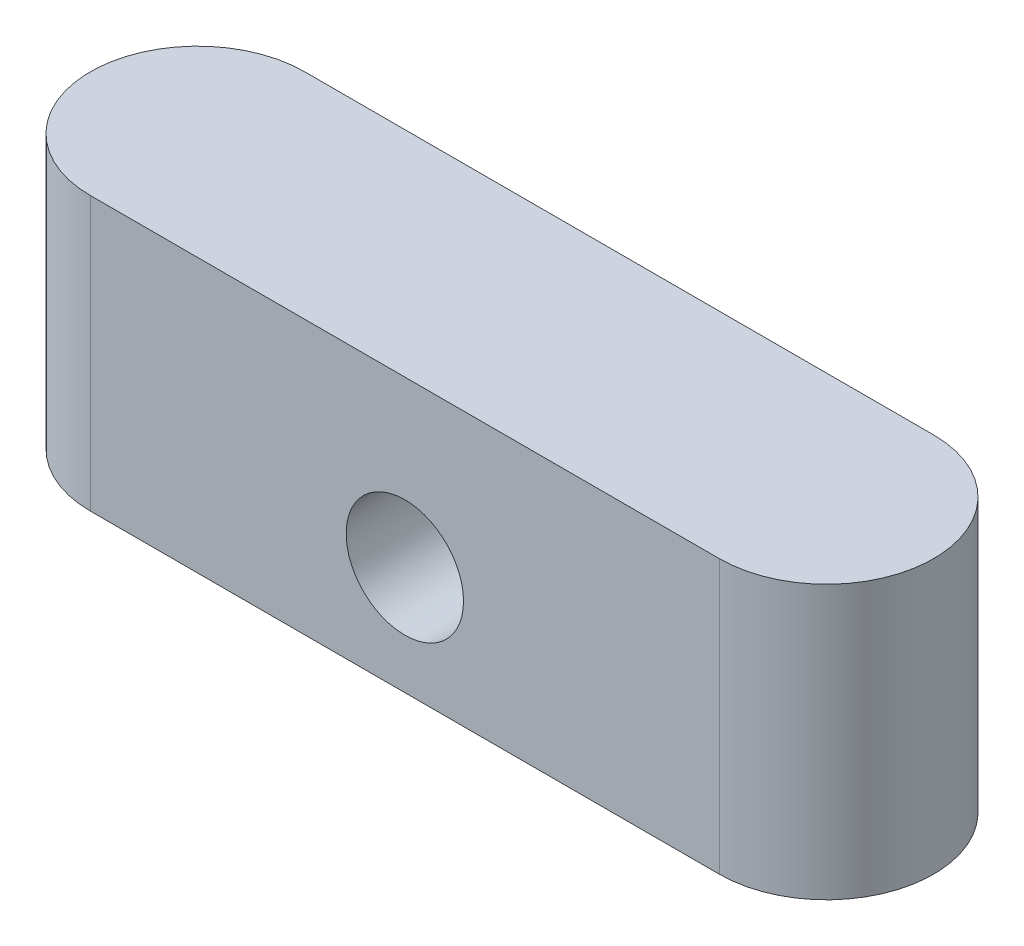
from build123d import *

# Parameters (mm, degrees)
BOSS_EXTRUDE1_DEPTH   = 3.15
F_6_32_TAPPED_HOLE1_D = 2.7051


with BuildPart() as part:
    # Sketch1 → Boss-Extrude1 (new, symmetric)
    with BuildSketch(Plane(origin=(0, 0, 0), x_dir=(1, 0, 0), z_dir=(0, 1, 0))):
        with BuildLine():
            Line((-7.25, 2.47015), (7.25, 2.47015))
            ThreePointArc((7.25, 2.47015), (9.72015, 0), (7.25, -2.47015))
            Line((7.25, -2.47015), (-7.25, -2.47015))
            ThreePointArc((-7.25, -2.47015), (-9.72015, 0), (-7.25, 2.47015))
        make_face()
    extrude(amount=BOSS_EXTRUDE1_DEPTH, both=True)

    # 6-32 Tapped Hole1 (through all)
    with Locations(Plane.XY.offset(2.47015)):
        with Locations((0, -0.65)):
            Hole(F_6_32_TAPPED_HOLE1_D / 2)


solid = part.part
